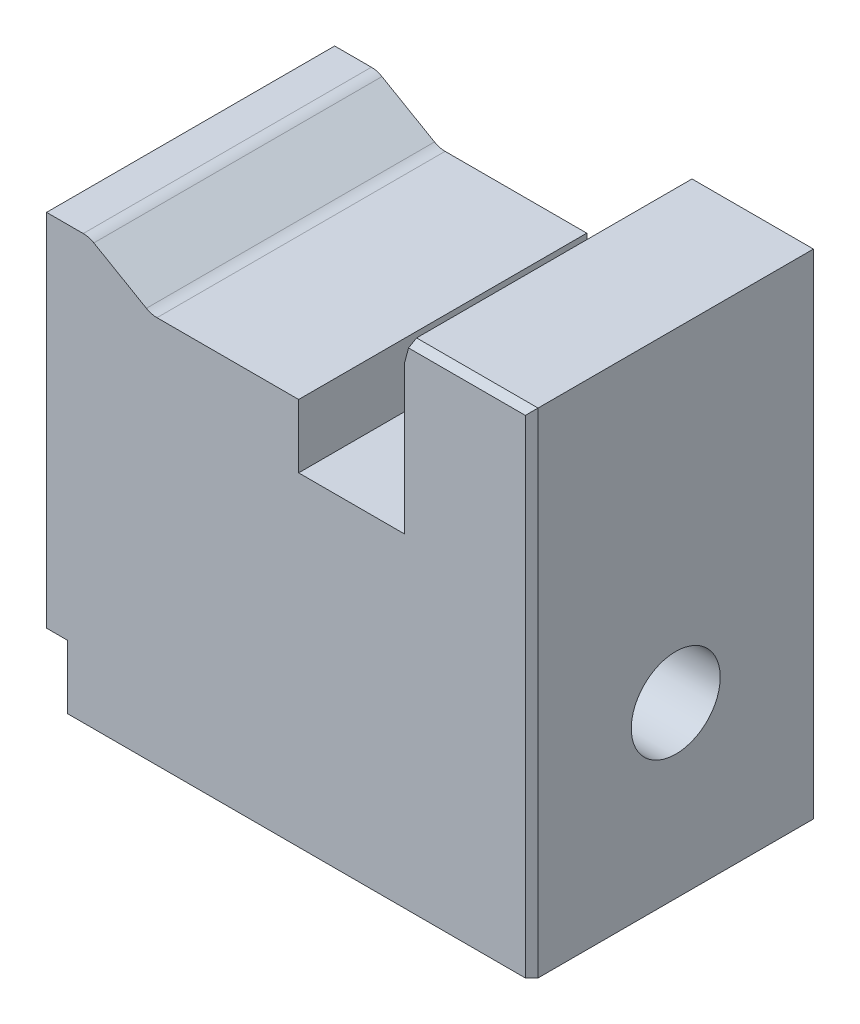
ISO-10303-21;
HEADER;
FILE_DESCRIPTION(('STEP AP214'),'2;1');
FILE_NAME('part.step','',(''),(''),'','','');
FILE_SCHEMA(('AUTOMOTIVE_DESIGN { 1 0 10303 214 1 1 1 1 }'));
ENDSEC;
DATA;
#1=APPLICATION_CONTEXT('core data for automotive mechanical design processes');
#2=APPLICATION_PROTOCOL_DEFINITION('international standard','automotive_design',2000,#1);
#3=PRODUCT_CONTEXT('',#1,'mechanical');
#4=PRODUCT('Part','Part','',(#3));
#5=PRODUCT_RELATED_PRODUCT_CATEGORY('part','',(#4));
#6=PRODUCT_DEFINITION_FORMATION('','',#4);
#7=PRODUCT_DEFINITION_CONTEXT('part definition',#1,'design');
#8=PRODUCT_DEFINITION('design','',#6,#7);
#9=PRODUCT_DEFINITION_SHAPE('','',#8);
#10=(LENGTH_UNIT() NAMED_UNIT(*) SI_UNIT(.MILLI.,.METRE.));
#11=(NAMED_UNIT(*) PLANE_ANGLE_UNIT() SI_UNIT($,.RADIAN.));
#12=(NAMED_UNIT(*) SI_UNIT($,.STERADIAN.) SOLID_ANGLE_UNIT());
#13=UNCERTAINTY_MEASURE_WITH_UNIT(LENGTH_MEASURE(1.E-05),#10,'distance_accuracy_value','');
#14=(GEOMETRIC_REPRESENTATION_CONTEXT(3) GLOBAL_UNCERTAINTY_ASSIGNED_CONTEXT((#13)) GLOBAL_UNIT_ASSIGNED_CONTEXT((#10,
#11,#12)) REPRESENTATION_CONTEXT('',''));
#15=CARTESIAN_POINT('',(0.,0.,0.));
#16=DIRECTION('',(0.,0.,1.));
#17=DIRECTION('',(1.,0.,0.));
#18=AXIS2_PLACEMENT_3D('',#15,#16,#17);
#19=CARTESIAN_POINT('',(0.,0.,13.6));
#20=DIRECTION('',(0.,1.,0.));
#21=DIRECTION('',(0.,0.,1.));
#22=AXIS2_PLACEMENT_3D('',#19,#20,#21);
#23=PLANE('',#22);
#24=DIRECTION('',(0.,0.,1.));
#25=VECTOR('',#24,1.);
#26=CARTESIAN_POINT('',(1.,0.,13.6));
#27=LINE('',#26,#25);
#28=CARTESIAN_POINT('',(1.,0.,0.));
#29=VERTEX_POINT('',#28);
#30=CARTESIAN_POINT('',(1.,0.,13.6));
#31=VERTEX_POINT('',#30);
#32=EDGE_CURVE('E307',#29,#31,#27,.T.);
#33=ORIENTED_EDGE('',*,*,#32,.F.);
#34=DIRECTION('',(1.,0.,0.));
#35=VECTOR('',#34,1.);
#36=CARTESIAN_POINT('',(0.,0.,0.));
#37=LINE('',#36,#35);
#38=CARTESIAN_POINT('',(22.6,0.,0.));
#39=VERTEX_POINT('',#38);
#40=EDGE_CURVE('E218',#29,#39,#37,.T.);
#41=ORIENTED_EDGE('',*,*,#40,.T.);
#42=DIRECTION('',(0.707106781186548,0.,0.707106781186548));
#43=VECTOR('',#42,1.);
#44=CARTESIAN_POINT('',(22.9,0.,0.300000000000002));
#45=LINE('',#44,#43);
#46=CARTESIAN_POINT('',(22.9,0.,0.300000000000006));
#47=VERTEX_POINT('',#46);
#48=EDGE_CURVE('E278',#39,#47,#45,.T.);
#49=ORIENTED_EDGE('',*,*,#48,.T.);
#50=DIRECTION('',(0.,0.,-1.));
#51=VECTOR('',#50,1.);
#52=CARTESIAN_POINT('',(22.9,0.,13.6));
#53=LINE('',#52,#51);
#54=CARTESIAN_POINT('',(22.9,0.,13.3));
#55=VERTEX_POINT('',#54);
#56=EDGE_CURVE('E258',#55,#47,#53,.T.);
#57=ORIENTED_EDGE('',*,*,#56,.F.);
#58=DIRECTION('',(0.707106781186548,0.,-0.707106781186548));
#59=VECTOR('',#58,1.);
#60=CARTESIAN_POINT('',(22.6,0.,13.6));
#61=LINE('',#60,#59);
#62=CARTESIAN_POINT('',(22.6,0.,13.6));
#63=VERTEX_POINT('',#62);
#64=EDGE_CURVE('E275',#55,#63,#61,.F.);
#65=ORIENTED_EDGE('',*,*,#64,.T.);
#66=DIRECTION('',(1.,0.,0.));
#67=VECTOR('',#66,1.);
#68=CARTESIAN_POINT('',(0.,0.,13.6));
#69=LINE('',#68,#67);
#70=EDGE_CURVE('E191',#31,#63,#69,.T.);
#71=ORIENTED_EDGE('',*,*,#70,.F.);
#72=EDGE_LOOP('',(#33,#41,#49,#57,#65,#71));
#73=FACE_BOUND('',#72,.T.);
#74=ADVANCED_FACE('F39',(#73),#23,.F.);
#75=CARTESIAN_POINT('',(0.,20.,13.6));
#76=DIRECTION('',(1.,0.,0.));
#77=DIRECTION('',(0.,1.,0.));
#78=AXIS2_PLACEMENT_3D('',#75,#76,#77);
#79=PLANE('',#78);
#80=DIRECTION('',(0.,-1.,0.));
#81=VECTOR('',#80,1.);
#82=CARTESIAN_POINT('',(0.,20.,0.));
#83=LINE('',#82,#81);
#84=CARTESIAN_POINT('',(0.,20.,0.));
#85=VERTEX_POINT('',#84);
#86=CARTESIAN_POINT('',(0.,3.,0.));
#87=VERTEX_POINT('',#86);
#88=EDGE_CURVE('E185',#85,#87,#83,.T.);
#89=ORIENTED_EDGE('',*,*,#88,.T.);
#90=DIRECTION('',(0.,0.,-1.));
#91=VECTOR('',#90,1.);
#92=CARTESIAN_POINT('',(0.,3.,-4.35740473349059));
#93=LINE('',#92,#91);
#94=CARTESIAN_POINT('',(0.,3.,13.6));
#95=VERTEX_POINT('',#94);
#96=EDGE_CURVE('E170',#95,#87,#93,.T.);
#97=ORIENTED_EDGE('',*,*,#96,.F.);
#98=DIRECTION('',(0.,-1.,0.));
#99=VECTOR('',#98,1.);
#100=CARTESIAN_POINT('',(0.,20.,13.6));
#101=LINE('',#100,#99);
#102=CARTESIAN_POINT('',(0.,20.,13.6));
#103=VERTEX_POINT('',#102);
#104=EDGE_CURVE('E183',#103,#95,#101,.T.);
#105=ORIENTED_EDGE('',*,*,#104,.F.);
#106=DIRECTION('',(0.,0.,-1.));
#107=VECTOR('',#106,1.);
#108=CARTESIAN_POINT('',(0.,20.,13.6));
#109=LINE('',#108,#107);
#110=EDGE_CURVE('E216',#103,#85,#109,.T.);
#111=ORIENTED_EDGE('',*,*,#110,.T.);
#112=EDGE_LOOP('',(#89,#97,#105,#111));
#113=FACE_BOUND('',#112,.T.);
#114=ADVANCED_FACE('F181',(#113),#79,.F.);
#115=CARTESIAN_POINT('',(22.9,0.,13.6));
#116=DIRECTION('',(-1.,0.,0.));
#117=DIRECTION('',(0.,0.,1.));
#118=AXIS2_PLACEMENT_3D('',#115,#116,#117);
#119=PLANE('',#118);
#120=CARTESIAN_POINT('',(22.9,8.,6.8));
#121=DIRECTION('',(1.,0.,0.));
#122=DIRECTION('',(0.,0.,-1.));
#123=AXIS2_PLACEMENT_3D('',#120,#121,#122);
#124=CIRCLE('',#123,2.09999999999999);
#125=CARTESIAN_POINT('',(22.9,8.,4.70000000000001));
#126=VERTEX_POINT('',#125);
#127=EDGE_CURVE('E288',#126,#126,#124,.T.);
#128=ORIENTED_EDGE('',*,*,#127,.F.);
#129=EDGE_LOOP('',(#128));
#130=FACE_BOUND('',#129,.T.);
#131=ORIENTED_EDGE('',*,*,#56,.T.);
#132=DIRECTION('',(0.,1.,0.));
#133=VECTOR('',#132,1.);
#134=CARTESIAN_POINT('',(22.9,23.3,0.300000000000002));
#135=LINE('',#134,#133);
#136=CARTESIAN_POINT('',(22.9,23.3,0.300000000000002));
#137=VERTEX_POINT('',#136);
#138=EDGE_CURVE('E273',#47,#137,#135,.T.);
#139=ORIENTED_EDGE('',*,*,#138,.T.);
#140=DIRECTION('',(0.,0.,-1.));
#141=VECTOR('',#140,1.);
#142=CARTESIAN_POINT('',(22.9,23.3,13.6));
#143=LINE('',#142,#141);
#144=CARTESIAN_POINT('',(22.9,23.3,13.3));
#145=VERTEX_POINT('',#144);
#146=EDGE_CURVE('E255',#145,#137,#143,.T.);
#147=ORIENTED_EDGE('',*,*,#146,.F.);
#148=DIRECTION('',(0.,-1.,0.));
#149=VECTOR('',#148,1.);
#150=CARTESIAN_POINT('',(22.9,0.,13.3));
#151=LINE('',#150,#149);
#152=EDGE_CURVE('E271',#145,#55,#151,.T.);
#153=ORIENTED_EDGE('',*,*,#152,.T.);
#154=EDGE_LOOP('',(#131,#139,#147,#153));
#155=FACE_BOUND('',#154,.T.);
#156=ADVANCED_FACE('F340',(#130,#155),#119,.F.);
#157=CARTESIAN_POINT('',(16.9,23.3,13.6));
#158=DIRECTION('',(0.,-1.,0.));
#159=DIRECTION('',(1.,0.,0.));
#160=AXIS2_PLACEMENT_3D('',#157,#158,#159);
#161=PLANE('',#160);
#162=DIRECTION('',(-1.,0.,0.));
#163=VECTOR('',#162,1.);
#164=CARTESIAN_POINT('',(16.9,23.3,0.300000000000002));
#165=LINE('',#164,#163);
#166=CARTESIAN_POINT('',(17.1679491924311,23.3,0.300000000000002));
#167=VERTEX_POINT('',#166);
#168=EDGE_CURVE('E263',#137,#167,#165,.T.);
#169=ORIENTED_EDGE('',*,*,#168,.T.);
#170=DIRECTION('',(0.,0.,1.));
#171=VECTOR('',#170,1.);
#172=CARTESIAN_POINT('',(17.1679491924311,23.3,13.6));
#173=LINE('',#172,#171);
#174=CARTESIAN_POINT('',(17.1679491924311,23.3,13.3));
#175=VERTEX_POINT('',#174);
#176=EDGE_CURVE('E297',#167,#175,#173,.T.);
#177=ORIENTED_EDGE('',*,*,#176,.T.);
#178=DIRECTION('',(1.,0.,0.));
#179=VECTOR('',#178,1.);
#180=CARTESIAN_POINT('',(16.9,23.3,13.3));
#181=LINE('',#180,#179);
#182=EDGE_CURVE('E261',#175,#145,#181,.T.);
#183=ORIENTED_EDGE('',*,*,#182,.T.);
#184=ORIENTED_EDGE('',*,*,#146,.T.);
#185=EDGE_LOOP('',(#169,#177,#183,#184));
#186=FACE_BOUND('',#185,.T.);
#187=ADVANCED_FACE('F371',(#186),#161,.F.);
#188=CARTESIAN_POINT('',(16.9,15.3,13.6));
#189=DIRECTION('',(1.,0.,0.));
#190=DIRECTION('',(0.,0.,-1.));
#191=AXIS2_PLACEMENT_3D('',#188,#189,#190);
#192=PLANE('',#191);
#193=DIRECTION('',(0.,-1.,0.));
#194=VECTOR('',#193,1.);
#195=CARTESIAN_POINT('',(16.9,15.3,13.6));
#196=LINE('',#195,#194);
#197=CARTESIAN_POINT('',(16.9,22.3,13.6));
#198=VERTEX_POINT('',#197);
#199=CARTESIAN_POINT('',(16.9,15.3,13.6));
#200=VERTEX_POINT('',#199);
#201=EDGE_CURVE('E194',#198,#200,#196,.T.);
#202=ORIENTED_EDGE('',*,*,#201,.F.);
#203=DIRECTION('',(0.,0.,-1.));
#204=VECTOR('',#203,1.);
#205=CARTESIAN_POINT('',(16.9,22.3,13.6));
#206=LINE('',#205,#204);
#207=CARTESIAN_POINT('',(16.9,22.3,0.));
#208=VERTEX_POINT('',#207);
#209=EDGE_CURVE('E284',#198,#208,#206,.T.);
#210=ORIENTED_EDGE('',*,*,#209,.T.);
#211=DIRECTION('',(0.,-1.,0.));
#212=VECTOR('',#211,1.);
#213=CARTESIAN_POINT('',(16.9,15.3,0.));
#214=LINE('',#213,#212);
#215=CARTESIAN_POINT('',(16.9,15.3,0.));
#216=VERTEX_POINT('',#215);
#217=EDGE_CURVE('E220',#208,#216,#214,.T.);
#218=ORIENTED_EDGE('',*,*,#217,.T.);
#219=DIRECTION('',(0.,0.,-1.));
#220=VECTOR('',#219,1.);
#221=CARTESIAN_POINT('',(16.9,15.3,13.6));
#222=LINE('',#221,#220);
#223=EDGE_CURVE('E252',#200,#216,#222,.T.);
#224=ORIENTED_EDGE('',*,*,#223,.F.);
#225=EDGE_LOOP('',(#202,#210,#218,#224));
#226=FACE_BOUND('',#225,.T.);
#227=ADVANCED_FACE('F378',(#226),#192,.F.);
#228=CARTESIAN_POINT('',(11.9,15.3,13.6));
#229=DIRECTION('',(0.,-1.,0.));
#230=DIRECTION('',(0.,0.,-1.));
#231=AXIS2_PLACEMENT_3D('',#228,#229,#230);
#232=PLANE('',#231);
#233=DIRECTION('',(-1.,0.,0.));
#234=VECTOR('',#233,1.);
#235=CARTESIAN_POINT('',(11.9,15.3,0.));
#236=LINE('',#235,#234);
#237=CARTESIAN_POINT('',(11.9,15.3,0.));
#238=VERTEX_POINT('',#237);
#239=EDGE_CURVE('E222',#216,#238,#236,.T.);
#240=ORIENTED_EDGE('',*,*,#239,.T.);
#241=DIRECTION('',(0.,0.,-1.));
#242=VECTOR('',#241,1.);
#243=CARTESIAN_POINT('',(11.9,15.3,13.6));
#244=LINE('',#243,#242);
#245=CARTESIAN_POINT('',(11.9,15.3,13.6));
#246=VERTEX_POINT('',#245);
#247=EDGE_CURVE('E249',#246,#238,#244,.T.);
#248=ORIENTED_EDGE('',*,*,#247,.F.);
#249=DIRECTION('',(-1.,0.,0.));
#250=VECTOR('',#249,1.);
#251=CARTESIAN_POINT('',(11.9,15.3,13.6));
#252=LINE('',#251,#250);
#253=EDGE_CURVE('E203',#200,#246,#252,.T.);
#254=ORIENTED_EDGE('',*,*,#253,.F.);
#255=ORIENTED_EDGE('',*,*,#223,.T.);
#256=EDGE_LOOP('',(#240,#248,#254,#255));
#257=FACE_BOUND('',#256,.T.);
#258=ADVANCED_FACE('F384',(#257),#232,.F.);
#259=CARTESIAN_POINT('',(11.9,18.3,13.6));
#260=DIRECTION('',(-1.,0.,0.));
#261=DIRECTION('',(0.,0.,1.));
#262=AXIS2_PLACEMENT_3D('',#259,#260,#261);
#263=PLANE('',#262);
#264=DIRECTION('',(0.,1.,0.));
#265=VECTOR('',#264,1.);
#266=CARTESIAN_POINT('',(11.9,18.3,0.));
#267=LINE('',#266,#265);
#268=CARTESIAN_POINT('',(11.9,18.3,0.));
#269=VERTEX_POINT('',#268);
#270=EDGE_CURVE('E224',#238,#269,#267,.T.);
#271=ORIENTED_EDGE('',*,*,#270,.T.);
#272=DIRECTION('',(0.,0.,-1.));
#273=VECTOR('',#272,1.);
#274=CARTESIAN_POINT('',(11.9,18.3,13.6));
#275=LINE('',#274,#273);
#276=CARTESIAN_POINT('',(11.9,18.3,13.6));
#277=VERTEX_POINT('',#276);
#278=EDGE_CURVE('E246',#277,#269,#275,.T.);
#279=ORIENTED_EDGE('',*,*,#278,.F.);
#280=DIRECTION('',(0.,1.,0.));
#281=VECTOR('',#280,1.);
#282=CARTESIAN_POINT('',(11.9,18.3,13.6));
#283=LINE('',#282,#281);
#284=EDGE_CURVE('E205',#246,#277,#283,.T.);
#285=ORIENTED_EDGE('',*,*,#284,.F.);
#286=ORIENTED_EDGE('',*,*,#247,.T.);
#287=EDGE_LOOP('',(#271,#279,#285,#286));
#288=FACE_BOUND('',#287,.T.);
#289=ADVANCED_FACE('F390',(#288),#263,.F.);
#290=CARTESIAN_POINT('',(5.21243556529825,18.3,13.6));
#291=DIRECTION('',(0.,-1.,0.));
#292=DIRECTION('',(0.,0.,-1.));
#293=AXIS2_PLACEMENT_3D('',#290,#291,#292);
#294=PLANE('',#293);
#295=DIRECTION('',(-1.,0.,0.));
#296=VECTOR('',#295,1.);
#297=CARTESIAN_POINT('',(5.21243556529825,18.3,0.));
#298=LINE('',#297,#296);
#299=CARTESIAN_POINT('',(5.21243556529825,18.3,0.));
#300=VERTEX_POINT('',#299);
#301=EDGE_CURVE('E226',#269,#300,#298,.T.);
#302=ORIENTED_EDGE('',*,*,#301,.T.);
#303=DIRECTION('',(0.,0.,-1.));
#304=VECTOR('',#303,1.);
#305=CARTESIAN_POINT('',(5.21243556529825,18.3,13.6));
#306=LINE('',#305,#304);
#307=CARTESIAN_POINT('',(5.21243556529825,18.3,13.6));
#308=VERTEX_POINT('',#307);
#309=EDGE_CURVE('E243',#308,#300,#306,.T.);
#310=ORIENTED_EDGE('',*,*,#309,.F.);
#311=DIRECTION('',(-1.,0.,0.));
#312=VECTOR('',#311,1.);
#313=CARTESIAN_POINT('',(5.21243556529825,18.3,13.6));
#314=LINE('',#313,#312);
#315=EDGE_CURVE('E207',#277,#308,#314,.T.);
#316=ORIENTED_EDGE('',*,*,#315,.F.);
#317=ORIENTED_EDGE('',*,*,#278,.T.);
#318=EDGE_LOOP('',(#302,#310,#316,#317));
#319=FACE_BOUND('',#318,.T.);
#320=ADVANCED_FACE('F394',(#319),#294,.F.);
#321=CARTESIAN_POINT('',(5.21243556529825,19.3,13.6));
#322=DIRECTION('',(0.,0.,-1.));
#323=DIRECTION('',(-1.,0.,0.));
#324=AXIS2_PLACEMENT_3D('',#321,#322,#323);
#325=CYLINDRICAL_SURFACE('',#324,0.999999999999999);
#326=CARTESIAN_POINT('',(5.21243556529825,19.3,0.));
#327=DIRECTION('',(0.,0.,-1.));
#328=DIRECTION('',(-1.,0.,0.));
#329=AXIS2_PLACEMENT_3D('',#326,#327,#328);
#330=CIRCLE('',#329,0.999999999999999);
#331=CARTESIAN_POINT('',(4.71243556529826,18.4339745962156,0.));
#332=VERTEX_POINT('',#331);
#333=EDGE_CURVE('E228',#300,#332,#330,.T.);
#334=ORIENTED_EDGE('',*,*,#333,.T.);
#335=DIRECTION('',(0.,0.,-1.));
#336=VECTOR('',#335,1.);
#337=CARTESIAN_POINT('',(4.71243556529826,18.4339745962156,13.6));
#338=LINE('',#337,#336);
#339=CARTESIAN_POINT('',(4.71243556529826,18.4339745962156,13.6));
#340=VERTEX_POINT('',#339);
#341=EDGE_CURVE('E240',#340,#332,#338,.T.);
#342=ORIENTED_EDGE('',*,*,#341,.F.);
#343=CARTESIAN_POINT('',(5.21243556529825,19.3,13.6));
#344=DIRECTION('',(0.,0.,-1.));
#345=DIRECTION('',(-1.,0.,0.));
#346=AXIS2_PLACEMENT_3D('',#343,#344,#345);
#347=CIRCLE('',#346,0.999999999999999);
#348=EDGE_CURVE('E209',#308,#340,#347,.T.);
#349=ORIENTED_EDGE('',*,*,#348,.F.);
#350=ORIENTED_EDGE('',*,*,#309,.T.);
#351=EDGE_LOOP('',(#334,#342,#349,#350));
#352=FACE_BOUND('',#351,.T.);
#353=ADVANCED_FACE('F399',(#352),#325,.F.);
#354=CARTESIAN_POINT('',(2.23205080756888,19.8660254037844,13.6));
#355=DIRECTION('',(-0.499999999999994,-0.866025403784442,0.));
#356=DIRECTION('',(0.866025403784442,-0.499999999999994,0.));
#357=AXIS2_PLACEMENT_3D('',#354,#355,#356);
#358=PLANE('',#357);
#359=DIRECTION('',(-0.866025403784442,0.499999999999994,0.));
#360=VECTOR('',#359,1.);
#361=CARTESIAN_POINT('',(2.23205080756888,19.8660254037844,0.));
#362=LINE('',#361,#360);
#363=CARTESIAN_POINT('',(2.23205080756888,19.8660254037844,0.));
#364=VERTEX_POINT('',#363);
#365=EDGE_CURVE('E230',#332,#364,#362,.T.);
#366=ORIENTED_EDGE('',*,*,#365,.T.);
#367=DIRECTION('',(0.,0.,-1.));
#368=VECTOR('',#367,1.);
#369=CARTESIAN_POINT('',(2.23205080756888,19.8660254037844,13.6));
#370=LINE('',#369,#368);
#371=CARTESIAN_POINT('',(2.23205080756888,19.8660254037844,13.6));
#372=VERTEX_POINT('',#371);
#373=EDGE_CURVE('E237',#372,#364,#370,.T.);
#374=ORIENTED_EDGE('',*,*,#373,.F.);
#375=DIRECTION('',(-0.866025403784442,0.499999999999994,0.));
#376=VECTOR('',#375,1.);
#377=CARTESIAN_POINT('',(2.23205080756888,19.8660254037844,13.6));
#378=LINE('',#377,#376);
#379=EDGE_CURVE('E211',#340,#372,#378,.T.);
#380=ORIENTED_EDGE('',*,*,#379,.F.);
#381=ORIENTED_EDGE('',*,*,#341,.T.);
#382=EDGE_LOOP('',(#366,#374,#380,#381));
#383=FACE_BOUND('',#382,.T.);
#384=ADVANCED_FACE('F405',(#383),#358,.F.);
#385=CARTESIAN_POINT('',(1.73205080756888,19.,13.6));
#386=DIRECTION('',(0.,0.,-1.));
#387=DIRECTION('',(-1.,0.,0.));
#388=AXIS2_PLACEMENT_3D('',#385,#386,#387);
#389=CYLINDRICAL_SURFACE('',#388,1.);
#390=CARTESIAN_POINT('',(1.73205080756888,19.,0.));
#391=DIRECTION('',(0.,0.,1.));
#392=DIRECTION('',(-1.,0.,0.));
#393=AXIS2_PLACEMENT_3D('',#390,#391,#392);
#394=CIRCLE('',#393,1.);
#395=CARTESIAN_POINT('',(1.73205080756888,20.,0.));
#396=VERTEX_POINT('',#395);
#397=EDGE_CURVE('E196',#364,#396,#394,.T.);
#398=ORIENTED_EDGE('',*,*,#397,.T.);
#399=DIRECTION('',(0.,0.,-1.));
#400=VECTOR('',#399,1.);
#401=CARTESIAN_POINT('',(1.73205080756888,20.,13.6));
#402=LINE('',#401,#400);
#403=CARTESIAN_POINT('',(1.73205080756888,20.,13.6));
#404=VERTEX_POINT('',#403);
#405=EDGE_CURVE('E234',#404,#396,#402,.T.);
#406=ORIENTED_EDGE('',*,*,#405,.F.);
#407=CARTESIAN_POINT('',(1.73205080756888,19.,13.6));
#408=DIRECTION('',(0.,0.,1.));
#409=DIRECTION('',(-1.,0.,0.));
#410=AXIS2_PLACEMENT_3D('',#407,#408,#409);
#411=CIRCLE('',#410,1.);
#412=EDGE_CURVE('E213',#372,#404,#411,.T.);
#413=ORIENTED_EDGE('',*,*,#412,.F.);
#414=ORIENTED_EDGE('',*,*,#373,.T.);
#415=EDGE_LOOP('',(#398,#406,#413,#414));
#416=FACE_BOUND('',#415,.T.);
#417=ADVANCED_FACE('F409',(#416),#389,.T.);
#418=CARTESIAN_POINT('',(1.73205080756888,20.,13.6));
#419=DIRECTION('',(0.,-1.,0.));
#420=DIRECTION('',(0.,0.,-1.));
#421=AXIS2_PLACEMENT_3D('',#418,#419,#420);
#422=PLANE('',#421);
#423=DIRECTION('',(-1.,0.,0.));
#424=VECTOR('',#423,1.);
#425=CARTESIAN_POINT('',(1.73205080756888,20.,0.));
#426=LINE('',#425,#424);
#427=EDGE_CURVE('E192',#396,#85,#426,.T.);
#428=ORIENTED_EDGE('',*,*,#427,.T.);
#429=ORIENTED_EDGE('',*,*,#110,.F.);
#430=DIRECTION('',(-1.,0.,0.));
#431=VECTOR('',#430,1.);
#432=CARTESIAN_POINT('',(1.73205080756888,20.,13.6));
#433=LINE('',#432,#431);
#434=EDGE_CURVE('E189',#404,#103,#433,.T.);
#435=ORIENTED_EDGE('',*,*,#434,.F.);
#436=ORIENTED_EDGE('',*,*,#405,.T.);
#437=EDGE_LOOP('',(#428,#429,#435,#436));
#438=FACE_BOUND('',#437,.T.);
#439=ADVANCED_FACE('F412',(#438),#422,.F.);
#440=CARTESIAN_POINT('',(5.21243556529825,19.3,13.6));
#441=DIRECTION('',(0.,0.,-1.));
#442=DIRECTION('',(-1.,0.,0.));
#443=AXIS2_PLACEMENT_3D('',#440,#441,#442);
#444=PLANE('',#443);
#445=ORIENTED_EDGE('',*,*,#104,.T.);
#446=DIRECTION('',(1.,0.,0.));
#447=VECTOR('',#446,1.);
#448=CARTESIAN_POINT('',(5.21243556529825,3.,13.6));
#449=LINE('',#448,#447);
#450=CARTESIAN_POINT('',(1.,3.,13.6));
#451=VERTEX_POINT('',#450);
#452=EDGE_CURVE('E167',#95,#451,#449,.T.);
#453=ORIENTED_EDGE('',*,*,#452,.T.);
#454=DIRECTION('',(0.,1.,0.));
#455=VECTOR('',#454,1.);
#456=CARTESIAN_POINT('',(1.,19.3,13.6));
#457=LINE('',#456,#455);
#458=EDGE_CURVE('E176',#31,#451,#457,.T.);
#459=ORIENTED_EDGE('',*,*,#458,.F.);
#460=ORIENTED_EDGE('',*,*,#70,.T.);
#461=DIRECTION('',(0.,1.,0.));
#462=VECTOR('',#461,1.);
#463=CARTESIAN_POINT('',(22.6,19.3,13.6));
#464=LINE('',#463,#462);
#465=CARTESIAN_POINT('',(22.6,23.,13.6));
#466=VERTEX_POINT('',#465);
#467=EDGE_CURVE('E280',#63,#466,#464,.T.);
#468=ORIENTED_EDGE('',*,*,#467,.T.);
#469=DIRECTION('',(-1.,0.,0.));
#470=VECTOR('',#469,1.);
#471=CARTESIAN_POINT('',(5.21243556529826,23.,13.6));
#472=LINE('',#471,#470);
#473=CARTESIAN_POINT('',(17.0875644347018,23.,13.6));
#474=VERTEX_POINT('',#473);
#475=EDGE_CURVE('E282',#466,#474,#472,.T.);
#476=ORIENTED_EDGE('',*,*,#475,.T.);
#477=DIRECTION('',(0.258819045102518,0.965925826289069,0.));
#478=VECTOR('',#477,1.);
#479=CARTESIAN_POINT('',(16.9,22.3,13.6));
#480=LINE('',#479,#478);
#481=EDGE_CURVE('E300',#474,#198,#480,.F.);
#482=ORIENTED_EDGE('',*,*,#481,.T.);
#483=ORIENTED_EDGE('',*,*,#201,.T.);
#484=ORIENTED_EDGE('',*,*,#253,.T.);
#485=ORIENTED_EDGE('',*,*,#284,.T.);
#486=ORIENTED_EDGE('',*,*,#315,.T.);
#487=ORIENTED_EDGE('',*,*,#348,.T.);
#488=ORIENTED_EDGE('',*,*,#379,.T.);
#489=ORIENTED_EDGE('',*,*,#412,.T.);
#490=ORIENTED_EDGE('',*,*,#434,.T.);
#491=EDGE_LOOP('',(#445,#453,#459,#460,#468,#476,#482,#483,#484,#485,#486,#487,#488,#489,#490));
#492=FACE_BOUND('',#491,.T.);
#493=ADVANCED_FACE('F187',(#492),#444,.F.);
#494=CARTESIAN_POINT('',(5.21243556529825,19.3,0.));
#495=DIRECTION('',(0.,0.,-1.));
#496=DIRECTION('',(-1.,0.,0.));
#497=AXIS2_PLACEMENT_3D('',#494,#495,#496);
#498=PLANE('',#497);
#499=DIRECTION('',(1.,0.,0.));
#500=VECTOR('',#499,1.);
#501=CARTESIAN_POINT('',(5.21243556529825,3.,0.));
#502=LINE('',#501,#500);
#503=CARTESIAN_POINT('',(1.,3.,0.));
#504=VERTEX_POINT('',#503);
#505=EDGE_CURVE('E11',#87,#504,#502,.T.);
#506=ORIENTED_EDGE('',*,*,#505,.F.);
#507=ORIENTED_EDGE('',*,*,#88,.F.);
#508=ORIENTED_EDGE('',*,*,#427,.F.);
#509=ORIENTED_EDGE('',*,*,#397,.F.);
#510=ORIENTED_EDGE('',*,*,#365,.F.);
#511=ORIENTED_EDGE('',*,*,#333,.F.);
#512=ORIENTED_EDGE('',*,*,#301,.F.);
#513=ORIENTED_EDGE('',*,*,#270,.F.);
#514=ORIENTED_EDGE('',*,*,#239,.F.);
#515=ORIENTED_EDGE('',*,*,#217,.F.);
#516=DIRECTION('',(-0.258819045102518,-0.965925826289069,0.));
#517=VECTOR('',#516,1.);
#518=CARTESIAN_POINT('',(15.3670816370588,16.5790707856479,0.));
#519=LINE('',#518,#517);
#520=CARTESIAN_POINT('',(17.0875644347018,23.,0.));
#521=VERTEX_POINT('',#520);
#522=EDGE_CURVE('E293',#208,#521,#519,.F.);
#523=ORIENTED_EDGE('',*,*,#522,.T.);
#524=DIRECTION('',(1.,0.,0.));
#525=VECTOR('',#524,1.);
#526=CARTESIAN_POINT('',(22.9,23.,0.));
#527=LINE('',#526,#525);
#528=CARTESIAN_POINT('',(22.6,23.,0.));
#529=VERTEX_POINT('',#528);
#530=EDGE_CURVE('E269',#521,#529,#527,.T.);
#531=ORIENTED_EDGE('',*,*,#530,.T.);
#532=DIRECTION('',(0.,-1.,0.));
#533=VECTOR('',#532,1.);
#534=CARTESIAN_POINT('',(22.6,0.,0.));
#535=LINE('',#534,#533);
#536=EDGE_CURVE('E266',#529,#39,#535,.T.);
#537=ORIENTED_EDGE('',*,*,#536,.T.);
#538=ORIENTED_EDGE('',*,*,#40,.F.);
#539=DIRECTION('',(0.,1.,0.));
#540=VECTOR('',#539,1.);
#541=CARTESIAN_POINT('',(1.,19.3,0.));
#542=LINE('',#541,#540);
#543=EDGE_CURVE('E47',#29,#504,#542,.T.);
#544=ORIENTED_EDGE('',*,*,#543,.T.);
#545=EDGE_LOOP('',(#506,#507,#508,#509,#510,#511,#512,#513,#514,#515,#523,#531,#537,#538,#544));
#546=FACE_BOUND('',#545,.T.);
#547=ADVANCED_FACE('F304',(#546),#498,.T.);
#548=CARTESIAN_POINT('',(10.5,8.,6.8));
#549=DIRECTION('',(1.,0.,0.));
#550=DIRECTION('',(0.,0.,-1.));
#551=AXIS2_PLACEMENT_3D('',#548,#549,#550);
#552=CONICAL_SURFACE('',#551,2.09999999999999,1.02974425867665);
#553=CARTESIAN_POINT('',(9.23819270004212,8.,6.8));
#554=VERTEX_POINT('',#553);
#555=VERTEX_LOOP('',#554);
#556=FACE_BOUND('',#555,.T.);
#557=CARTESIAN_POINT('',(10.5,8.,6.8));
#558=DIRECTION('',(1.,0.,0.));
#559=DIRECTION('',(0.,0.,-1.));
#560=AXIS2_PLACEMENT_3D('',#557,#558,#559);
#561=CIRCLE('',#560,2.09999999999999);
#562=CARTESIAN_POINT('',(10.5,8.,4.70000000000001));
#563=VERTEX_POINT('',#562);
#564=EDGE_CURVE('E199',#563,#563,#561,.T.);
#565=ORIENTED_EDGE('',*,*,#564,.T.);
#566=EDGE_LOOP('',(#565));
#567=FACE_BOUND('',#566,.T.);
#568=ADVANCED_FACE('F319',(#556,#567),#552,.F.);
#569=CARTESIAN_POINT('',(22.9,8.,6.8));
#570=DIRECTION('',(1.,0.,0.));
#571=DIRECTION('',(0.,0.,-1.));
#572=AXIS2_PLACEMENT_3D('',#569,#570,#571);
#573=CYLINDRICAL_SURFACE('',#572,2.09999999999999);
#574=ORIENTED_EDGE('',*,*,#564,.F.);
#575=EDGE_LOOP('',(#574));
#576=FACE_BOUND('',#575,.T.);
#577=ORIENTED_EDGE('',*,*,#127,.T.);
#578=EDGE_LOOP('',(#577));
#579=FACE_BOUND('',#578,.T.);
#580=ADVANCED_FACE('F321',(#576,#579),#573,.F.);
#581=CARTESIAN_POINT('',(22.9,0.,0.300000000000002));
#582=DIRECTION('',(0.707106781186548,0.,-0.707106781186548));
#583=DIRECTION('',(0.,-1.,0.));
#584=AXIS2_PLACEMENT_3D('',#581,#582,#583);
#585=PLANE('',#584);
#586=ORIENTED_EDGE('',*,*,#48,.F.);
#587=ORIENTED_EDGE('',*,*,#536,.F.);
#588=DIRECTION('',(0.577350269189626,0.577350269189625,0.577350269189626));
#589=VECTOR('',#588,1.);
#590=CARTESIAN_POINT('',(15.1333333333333,15.5333333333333,-7.46666666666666));
#591=LINE('',#590,#589);
#592=EDGE_CURVE('E285',#137,#529,#591,.F.);
#593=ORIENTED_EDGE('',*,*,#592,.F.);
#594=ORIENTED_EDGE('',*,*,#138,.F.);
#595=EDGE_LOOP('',(#586,#587,#593,#594));
#596=FACE_BOUND('',#595,.T.);
#597=ADVANCED_FACE('F323',(#596),#585,.T.);
#598=CARTESIAN_POINT('',(16.9,23.3,0.300000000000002));
#599=DIRECTION('',(0.,0.707106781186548,-0.707106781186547));
#600=DIRECTION('',(1.,0.,0.));
#601=AXIS2_PLACEMENT_3D('',#598,#599,#600);
#602=PLANE('',#601);
#603=ORIENTED_EDGE('',*,*,#530,.F.);
#604=DIRECTION('',(-0.186156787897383,-0.694746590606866,-0.694746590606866));
#605=VECTOR('',#604,1.);
#606=CARTESIAN_POINT('',(17.1586635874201,23.2653456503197,0.26534565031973));
#607=LINE('',#606,#605);
#608=EDGE_CURVE('E295',#521,#167,#607,.F.);
#609=ORIENTED_EDGE('',*,*,#608,.T.);
#610=ORIENTED_EDGE('',*,*,#168,.F.);
#611=ORIENTED_EDGE('',*,*,#592,.T.);
#612=EDGE_LOOP('',(#603,#609,#610,#611));
#613=FACE_BOUND('',#612,.T.);
#614=ADVANCED_FACE('F329',(#613),#602,.T.);
#615=CARTESIAN_POINT('',(22.6,19.3,13.6));
#616=DIRECTION('',(-0.707106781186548,0.,-0.707106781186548));
#617=DIRECTION('',(0.,1.,0.));
#618=AXIS2_PLACEMENT_3D('',#615,#616,#617);
#619=PLANE('',#618);
#620=ORIENTED_EDGE('',*,*,#64,.F.);
#621=ORIENTED_EDGE('',*,*,#152,.F.);
#622=DIRECTION('',(-0.577350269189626,-0.577350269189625,0.577350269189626));
#623=VECTOR('',#622,1.);
#624=CARTESIAN_POINT('',(21.3666666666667,21.7666666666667,14.8333333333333));
#625=LINE('',#624,#623);
#626=EDGE_CURVE('E175',#466,#145,#625,.F.);
#627=ORIENTED_EDGE('',*,*,#626,.F.);
#628=ORIENTED_EDGE('',*,*,#467,.F.);
#629=EDGE_LOOP('',(#620,#621,#627,#628));
#630=FACE_BOUND('',#629,.T.);
#631=ADVANCED_FACE('F346',(#630),#619,.F.);
#632=CARTESIAN_POINT('',(5.21243556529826,23.,13.6));
#633=DIRECTION('',(0.,-0.707106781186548,-0.707106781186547));
#634=DIRECTION('',(-1.,0.,0.));
#635=AXIS2_PLACEMENT_3D('',#632,#633,#634);
#636=PLANE('',#635);
#637=ORIENTED_EDGE('',*,*,#182,.F.);
#638=DIRECTION('',(-0.186156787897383,-0.694746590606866,0.694746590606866));
#639=VECTOR('',#638,1.);
#640=CARTESIAN_POINT('',(16.6760395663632,21.4641682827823,15.1358317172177));
#641=LINE('',#640,#639);
#642=EDGE_CURVE('E61',#175,#474,#641,.T.);
#643=ORIENTED_EDGE('',*,*,#642,.T.);
#644=ORIENTED_EDGE('',*,*,#475,.F.);
#645=ORIENTED_EDGE('',*,*,#626,.T.);
#646=EDGE_LOOP('',(#637,#643,#644,#645));
#647=FACE_BOUND('',#646,.T.);
#648=ADVANCED_FACE('F349',(#647),#636,.F.);
#649=CARTESIAN_POINT('',(16.9,22.3,13.6));
#650=DIRECTION('',(0.965925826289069,-0.258819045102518,0.));
#651=DIRECTION('',(0.,0.,-1.));
#652=AXIS2_PLACEMENT_3D('',#649,#650,#651);
#653=PLANE('',#652);
#654=ORIENTED_EDGE('',*,*,#642,.F.);
#655=ORIENTED_EDGE('',*,*,#176,.F.);
#656=ORIENTED_EDGE('',*,*,#608,.F.);
#657=ORIENTED_EDGE('',*,*,#522,.F.);
#658=ORIENTED_EDGE('',*,*,#209,.F.);
#659=ORIENTED_EDGE('',*,*,#481,.F.);
#660=EDGE_LOOP('',(#654,#655,#656,#657,#658,#659));
#661=FACE_BOUND('',#660,.T.);
#662=ADVANCED_FACE('F41',(#661),#653,.F.);
#663=CARTESIAN_POINT('',(1.,3.,-4.35740473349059));
#664=DIRECTION('',(0.,1.,0.));
#665=DIRECTION('',(-1.,0.,0.));
#666=AXIS2_PLACEMENT_3D('',#663,#664,#665);
#667=PLANE('',#666);
#668=ORIENTED_EDGE('',*,*,#96,.T.);
#669=ORIENTED_EDGE('',*,*,#505,.T.);
#670=DIRECTION('',(0.,0.,-1.));
#671=VECTOR('',#670,1.);
#672=CARTESIAN_POINT('',(1.,3.,-4.35740473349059));
#673=LINE('',#672,#671);
#674=EDGE_CURVE('E54',#451,#504,#673,.T.);
#675=ORIENTED_EDGE('',*,*,#674,.F.);
#676=ORIENTED_EDGE('',*,*,#452,.F.);
#677=EDGE_LOOP('',(#668,#669,#675,#676));
#678=FACE_BOUND('',#677,.T.);
#679=ADVANCED_FACE('F169',(#678),#667,.F.);
#680=CARTESIAN_POINT('',(1.,0.,0.));
#681=DIRECTION('',(-1.,0.,0.));
#682=DIRECTION('',(0.,-1.,0.));
#683=AXIS2_PLACEMENT_3D('',#680,#681,#682);
#684=PLANE('',#683);
#685=ORIENTED_EDGE('',*,*,#458,.T.);
#686=ORIENTED_EDGE('',*,*,#674,.T.);
#687=ORIENTED_EDGE('',*,*,#543,.F.);
#688=ORIENTED_EDGE('',*,*,#32,.T.);
#689=EDGE_LOOP('',(#685,#686,#687,#688));
#690=FACE_BOUND('',#689,.T.);
#691=ADVANCED_FACE('F306',(#690),#684,.T.);
#692=CLOSED_SHELL('',(#74,#114,#156,#187,#227,#258,#289,#320,#353,#384,#417,#439,#493,#547,#568,
#580,#597,#614,#631,#648,#662,#679,#691));
#693=MANIFOLD_SOLID_BREP('B2',#692);
#694=ADVANCED_BREP_SHAPE_REPRESENTATION('',(#18,#693),#14);
#695=SHAPE_DEFINITION_REPRESENTATION(#9,#694);
ENDSEC;
END-ISO-10303-21;
